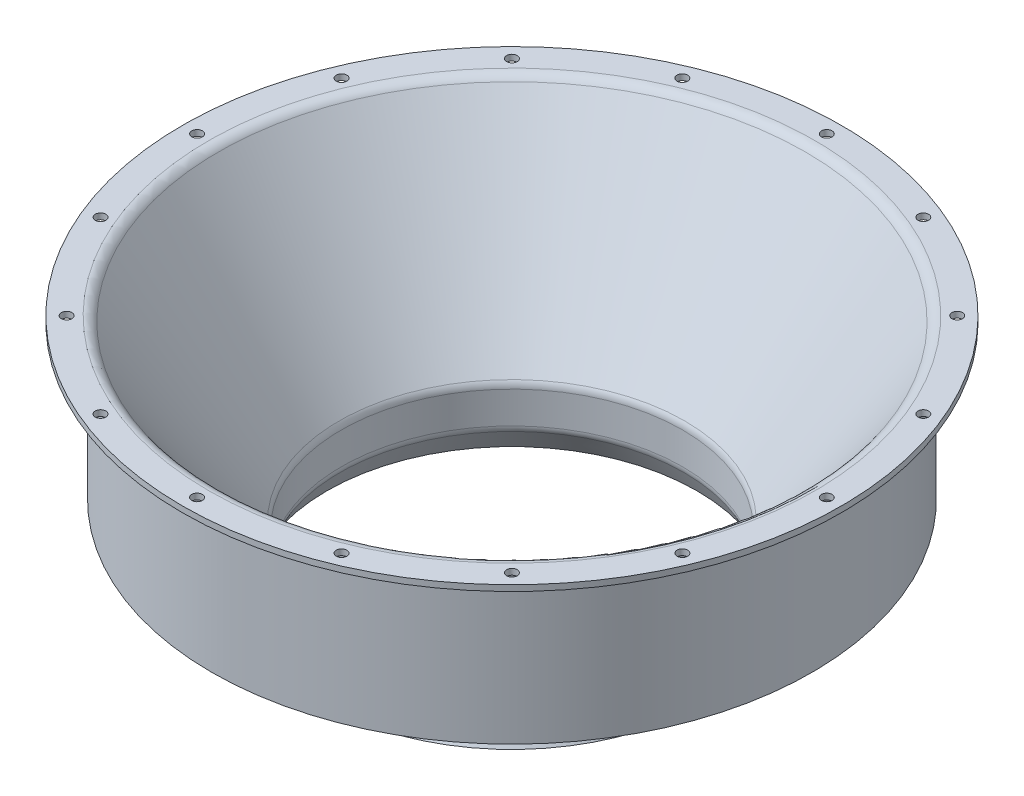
from build123d import *

# Parameters (mm, degrees)
FILLET_1_R               = 10
HOLE_WIZARD_1_D          = 9
PATTERN_CIRCULAR_1_COUNT = 16


with BuildPart() as part:
    # Sketch 1 → Revolve 1 (revolve)
    with BuildSketch(Plane.XY, mode=Mode.PRIVATE) as revolve_1_sk:
        Polygon((-280, 0), (-255, 0), (-150, -150), (-150, -180), (-161.547005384, -200), (-157.216878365, -202.5), (-145, -181.339745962), (-145, -148.423888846), (-252.396722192, 5), (-280, 5), align=None)
    revolve(revolve_1_sk.sketch.rotate(Axis((0, 0, 0), (0, -1, 0)), 270), axis=Axis((0, 0, 0), (0, -1, 0)))

    # Fillet 1
    fillet_1_edges = [part.edges().sort_by_distance(p)[0] for p in [
        (0, 5, -252.396722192),
        (0, -148.423888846, -145),
        (0, -181.339745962, -145),
    ]]
    fillet(fillet_1_edges, radius=FILLET_1_R)

    # Sketch 2 → Revolve 2 (revolve)
    with BuildSketch(Plane.XY, mode=Mode.PRIVATE) as revolve_2_sk:
        Polygon((-255, 0), (-255, -130), (-164, -130), (-167.5, -125), (-250, -125), (-250, -7.142857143), align=None)
    revolve(revolve_2_sk.sketch.rotate(Axis((0, 73.714438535, 0), (0, -1, 0)), 270), axis=Axis((0, 73.714438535, 0), (0, -1, 0)))

    # Hole Wizard 1 (through all)
    with Locations(Plane(origin=(0, 5, 0), x_dir=(-1, 0, 0), z_dir=(0, 1, 0))):
        with Locations((0, 267.5)):
            hole_wizard_1 = Hole(HOLE_WIZARD_1_D / 2)

    # Pattern Circular 1: Hole Wizard 1 ×16 about axis
    pattern_circular_1_axis = Axis((0, 0, 0), (0, 1, 0))
    for i in range(1, PATTERN_CIRCULAR_1_COUNT):
        add(hole_wizard_1.rotate(pattern_circular_1_axis, i * 360 / PATTERN_CIRCULAR_1_COUNT), mode=Mode.SUBTRACT)


solid = part.part
